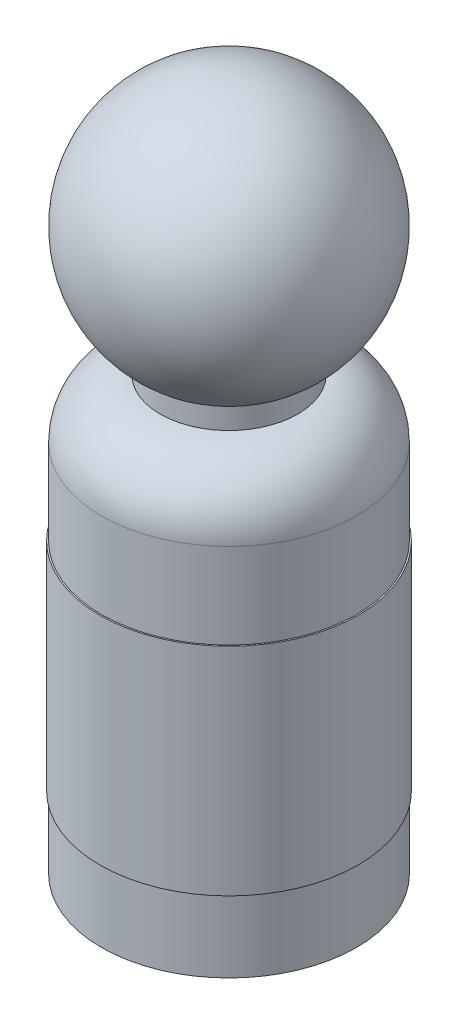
ISO-10303-21;
HEADER;
FILE_DESCRIPTION(('STEP AP214'),'2;1');
FILE_NAME('part.step','',(''),(''),'','','');
FILE_SCHEMA(('AUTOMOTIVE_DESIGN { 1 0 10303 214 1 1 1 1 }'));
ENDSEC;
DATA;
#1=APPLICATION_CONTEXT('core data for automotive mechanical design processes');
#2=APPLICATION_PROTOCOL_DEFINITION('international standard','automotive_design',2000,#1);
#3=PRODUCT_CONTEXT('',#1,'mechanical');
#4=PRODUCT('Part','Part','',(#3));
#5=PRODUCT_RELATED_PRODUCT_CATEGORY('part','',(#4));
#6=PRODUCT_DEFINITION_FORMATION('','',#4);
#7=PRODUCT_DEFINITION_CONTEXT('part definition',#1,'design');
#8=PRODUCT_DEFINITION('design','',#6,#7);
#9=PRODUCT_DEFINITION_SHAPE('','',#8);
#10=(LENGTH_UNIT() NAMED_UNIT(*) SI_UNIT(.MILLI.,.METRE.));
#11=(NAMED_UNIT(*) PLANE_ANGLE_UNIT() SI_UNIT($,.RADIAN.));
#12=(NAMED_UNIT(*) SI_UNIT($,.STERADIAN.) SOLID_ANGLE_UNIT());
#13=UNCERTAINTY_MEASURE_WITH_UNIT(LENGTH_MEASURE(1.E-05),#10,'distance_accuracy_value','');
#14=(GEOMETRIC_REPRESENTATION_CONTEXT(3) GLOBAL_UNCERTAINTY_ASSIGNED_CONTEXT((#13)) GLOBAL_UNIT_ASSIGNED_CONTEXT((#10,
#11,#12)) REPRESENTATION_CONTEXT('',''));
#15=CARTESIAN_POINT('',(0.,0.,0.));
#16=DIRECTION('',(0.,0.,1.));
#17=DIRECTION('',(1.,0.,0.));
#18=AXIS2_PLACEMENT_3D('',#15,#16,#17);
#19=CARTESIAN_POINT('',(0.,38.1,0.));
#20=DIRECTION('',(0.,-1.,0.));
#21=DIRECTION('',(0.,0.,-1.));
#22=AXIS2_PLACEMENT_3D('',#19,#20,#21);
#23=CYLINDRICAL_SURFACE('',#22,11.2395);
#24=CARTESIAN_POINT('',(0.,32.9184,0.));
#25=DIRECTION('',(0.,1.,0.));
#26=DIRECTION('',(0.,0.,1.));
#27=AXIS2_PLACEMENT_3D('',#24,#25,#26);
#28=CIRCLE('',#27,11.2395);
#29=CARTESIAN_POINT('',(0.,32.9184,-11.2395));
#30=VERTEX_POINT('',#29);
#31=EDGE_CURVE('E40',#30,#30,#28,.F.);
#32=CARTESIAN_POINT('',(0.,25.4,0.));
#33=DIRECTION('',(0.,-1.,0.));
#34=DIRECTION('',(0.,0.,-1.));
#35=AXIS2_PLACEMENT_3D('',#32,#33,#34);
#36=CIRCLE('',#35,11.2395);
#37=CARTESIAN_POINT('',(0.,25.4,-11.2395));
#38=VERTEX_POINT('',#37);
#39=EDGE_CURVE('E10',#38,#38,#36,.T.);
#40=CARTESIAN_POINT('',(0.,32.9184,-11.2395));
#41=CARTESIAN_POINT('',(0.,32.8400833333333,-11.2395));
#42=CARTESIAN_POINT('',(0.,32.7617666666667,-11.2395));
#43=CARTESIAN_POINT('',(0.,32.6051333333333,-11.2395));
#44=CARTESIAN_POINT('',(0.,32.5268166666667,-11.2395));
#45=CARTESIAN_POINT('',(0.,32.3701833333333,-11.2395));
#46=CARTESIAN_POINT('',(0.,32.2918666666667,-11.2395));
#47=CARTESIAN_POINT('',(0.,32.1352333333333,-11.2395));
#48=CARTESIAN_POINT('',(0.,32.0569166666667,-11.2395));
#49=CARTESIAN_POINT('',(0.,31.9002833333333,-11.2395));
#50=CARTESIAN_POINT('',(0.,31.8219666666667,-11.2395));
#51=CARTESIAN_POINT('',(0.,31.6653333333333,-11.2395));
#52=CARTESIAN_POINT('',(0.,31.5870166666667,-11.2395));
#53=CARTESIAN_POINT('',(0.,31.4303833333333,-11.2395));
#54=CARTESIAN_POINT('',(0.,31.3520666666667,-11.2395));
#55=CARTESIAN_POINT('',(0.,31.1954333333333,-11.2395));
#56=CARTESIAN_POINT('',(0.,31.1171166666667,-11.2395));
#57=CARTESIAN_POINT('',(0.,30.9604833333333,-11.2395));
#58=CARTESIAN_POINT('',(0.,30.8821666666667,-11.2395));
#59=CARTESIAN_POINT('',(0.,30.7255333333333,-11.2395));
#60=CARTESIAN_POINT('',(0.,30.6472166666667,-11.2395));
#61=CARTESIAN_POINT('',(0.,30.4905833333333,-11.2395));
#62=CARTESIAN_POINT('',(0.,30.4122666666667,-11.2395));
#63=CARTESIAN_POINT('',(0.,30.2556333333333,-11.2395));
#64=CARTESIAN_POINT('',(0.,30.1773166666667,-11.2395));
#65=CARTESIAN_POINT('',(0.,30.0206833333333,-11.2395));
#66=CARTESIAN_POINT('',(0.,29.9423666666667,-11.2395));
#67=CARTESIAN_POINT('',(0.,29.7857333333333,-11.2395));
#68=CARTESIAN_POINT('',(0.,29.7074166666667,-11.2395));
#69=CARTESIAN_POINT('',(0.,29.5507833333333,-11.2395));
#70=CARTESIAN_POINT('',(0.,29.4724666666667,-11.2395));
#71=CARTESIAN_POINT('',(0.,29.3158333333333,-11.2395));
#72=CARTESIAN_POINT('',(0.,29.2375166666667,-11.2395));
#73=CARTESIAN_POINT('',(0.,29.0808833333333,-11.2395));
#74=CARTESIAN_POINT('',(0.,29.0025666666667,-11.2395));
#75=CARTESIAN_POINT('',(0.,28.8459333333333,-11.2395));
#76=CARTESIAN_POINT('',(0.,28.7676166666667,-11.2395));
#77=CARTESIAN_POINT('',(0.,28.6109833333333,-11.2395));
#78=CARTESIAN_POINT('',(0.,28.5326666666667,-11.2395));
#79=CARTESIAN_POINT('',(0.,28.3760333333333,-11.2395));
#80=CARTESIAN_POINT('',(0.,28.2977166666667,-11.2395));
#81=CARTESIAN_POINT('',(0.,28.1410833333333,-11.2395));
#82=CARTESIAN_POINT('',(0.,28.0627666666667,-11.2395));
#83=CARTESIAN_POINT('',(0.,27.9061333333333,-11.2395));
#84=CARTESIAN_POINT('',(0.,27.8278166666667,-11.2395));
#85=CARTESIAN_POINT('',(0.,27.6711833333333,-11.2395));
#86=CARTESIAN_POINT('',(0.,27.5928666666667,-11.2395));
#87=CARTESIAN_POINT('',(0.,27.4362333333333,-11.2395));
#88=CARTESIAN_POINT('',(0.,27.3579166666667,-11.2395));
#89=CARTESIAN_POINT('',(0.,27.2012833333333,-11.2395));
#90=CARTESIAN_POINT('',(0.,27.1229666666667,-11.2395));
#91=CARTESIAN_POINT('',(0.,26.9663333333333,-11.2395));
#92=CARTESIAN_POINT('',(0.,26.8880166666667,-11.2395));
#93=CARTESIAN_POINT('',(0.,26.7313833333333,-11.2395));
#94=CARTESIAN_POINT('',(0.,26.6530666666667,-11.2395));
#95=CARTESIAN_POINT('',(0.,26.4964333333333,-11.2395));
#96=CARTESIAN_POINT('',(0.,26.4181166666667,-11.2395));
#97=CARTESIAN_POINT('',(0.,26.2614833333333,-11.2395));
#98=CARTESIAN_POINT('',(0.,26.1831666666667,-11.2395));
#99=CARTESIAN_POINT('',(0.,26.0265333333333,-11.2395));
#100=CARTESIAN_POINT('',(0.,25.9482166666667,-11.2395));
#101=CARTESIAN_POINT('',(0.,25.7915833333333,-11.2395));
#102=CARTESIAN_POINT('',(0.,25.7132666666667,-11.2395));
#103=CARTESIAN_POINT('',(0.,25.5566333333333,-11.2395));
#104=CARTESIAN_POINT('',(0.,25.4783166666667,-11.2395));
#105=CARTESIAN_POINT('',(0.,25.4,-11.2395));
#106=B_SPLINE_CURVE_WITH_KNOTS('',3,(#40,#41,#42,#43,#44,#45,#46,#47,#48,#49,#50,#51,#52,#53,
#54,#55,#56,#57,#58,#59,#60,#61,#62,#63,#64,#65,#66,#67,#68,#69,#70,#71,#72,#73,#74,#75,#76,#77,
#78,#79,#80,#81,#82,#83,#84,#85,#86,#87,#88,#89,#90,#91,#92,#93,#94,#95,#96,#97,#98,#99,#100,
#101,#102,#103,#104,#105),.UNSPECIFIED.,.F.,.F.,(4,2,2,2,2,2,2,2,2,2,2,2,2,2,2,2,2,2,2,2,2,2,2,
2,2,2,2,2,2,2,2,2,4),(0.,0.234949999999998,0.469899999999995,0.70485,0.939799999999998,1.17475,
1.4097,1.64465,1.8796,2.11455,2.3495,2.58445,2.81939999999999,3.05435,3.2893,3.52424999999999,
3.7592,3.99414999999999,4.22909999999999,4.46405,4.69899999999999,4.93394999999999,
5.16889999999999,5.40384999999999,5.63879999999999,5.87374999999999,6.10869999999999,
6.34364999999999,6.57859999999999,6.81354999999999,7.04849999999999,7.28344999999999,
7.51839999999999),.UNSPECIFIED.);
#107=EDGE_CURVE('BSEAM33',#30,#38,#106,.T.);
#108=ORIENTED_EDGE('',*,*,#31,.T.);
#109=ORIENTED_EDGE('',*,*,#39,.F.);
#110=ORIENTED_EDGE('',*,*,#107,.T.);
#111=ORIENTED_EDGE('',*,*,#107,.F.);
#112=EDGE_LOOP('',(#108,#110,#109,#111));
#113=FACE_BOUND('',#112,.T.);
#114=ADVANCED_FACE('F33',(#113),#23,.T.);
#115=CARTESIAN_POINT('',(0.,32.9184,0.));
#116=DIRECTION('',(0.,1.,0.));
#117=DIRECTION('',(0.,0.,1.));
#118=AXIS2_PLACEMENT_3D('',#115,#116,#117);
#119=TOROIDAL_SURFACE('',#118,6.0579,5.1816);
#120=ORIENTED_EDGE('',*,*,#31,.F.);
#121=EDGE_LOOP('',(#120));
#122=FACE_BOUND('',#121,.T.);
#123=CARTESIAN_POINT('',(0.,38.1,0.));
#124=DIRECTION('',(0.,1.,0.));
#125=DIRECTION('',(0.,0.,1.));
#126=AXIS2_PLACEMENT_3D('',#123,#124,#125);
#127=CIRCLE('',#126,6.0579);
#128=CARTESIAN_POINT('',(0.,38.1,6.0579));
#129=VERTEX_POINT('',#128);
#130=EDGE_CURVE('E44',#129,#129,#127,.T.);
#131=ORIENTED_EDGE('',*,*,#130,.F.);
#132=EDGE_LOOP('',(#131));
#133=FACE_BOUND('',#132,.T.);
#134=ADVANCED_FACE('F35',(#122,#133),#119,.T.);
#135=CARTESIAN_POINT('',(0.,39.9415,0.));
#136=DIRECTION('',(0.,-1.,0.));
#137=DIRECTION('',(0.,0.,-1.));
#138=AXIS2_PLACEMENT_3D('',#135,#136,#137);
#139=CYLINDRICAL_SURFACE('',#138,6.0579);
#140=CARTESIAN_POINT('',(0.,39.9415,0.));
#141=DIRECTION('',(0.,1.,0.));
#142=DIRECTION('',(0.,0.,1.));
#143=AXIS2_PLACEMENT_3D('',#140,#141,#142);
#144=CIRCLE('',#143,6.0579);
#145=CARTESIAN_POINT('',(0.,39.9415,6.0579));
#146=VERTEX_POINT('',#145);
#147=EDGE_CURVE('E53',#146,#146,#144,.T.);
#148=ORIENTED_EDGE('',*,*,#147,.F.);
#149=EDGE_LOOP('',(#148));
#150=FACE_BOUND('',#149,.T.);
#151=ORIENTED_EDGE('',*,*,#130,.T.);
#152=EDGE_LOOP('',(#151));
#153=FACE_BOUND('',#152,.T.);
#154=ADVANCED_FACE('F87',(#150,#153),#139,.T.);
#155=CARTESIAN_POINT('',(0.,49.4087175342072,0.));
#156=DIRECTION('',(0.,1.,0.));
#157=DIRECTION('',(1.,0.,0.));
#158=AXIS2_PLACEMENT_3D('',#155,#156,#157);
#159=SPHERICAL_SURFACE('',#158,11.2395);
#160=ORIENTED_EDGE('',*,*,#147,.T.);
#161=EDGE_LOOP('',(#160));
#162=FACE_BOUND('',#161,.T.);
#163=ADVANCED_FACE('F79',(#162),#159,.T.);
#164=CARTESIAN_POINT('',(0.,25.4,0.));
#165=DIRECTION('',(0.,-1.,0.));
#166=DIRECTION('',(0.,0.,-1.));
#167=AXIS2_PLACEMENT_3D('',#164,#165,#166);
#168=CYLINDRICAL_SURFACE('',#167,11.3665);
#169=CARTESIAN_POINT('',(0.,25.4,0.));
#170=DIRECTION('',(0.,-1.,0.));
#171=DIRECTION('',(0.,0.,-1.));
#172=AXIS2_PLACEMENT_3D('',#169,#170,#171);
#173=CIRCLE('',#172,11.3665);
#174=CARTESIAN_POINT('',(0.,25.4,-11.3665));
#175=VERTEX_POINT('',#174);
#176=EDGE_CURVE('E56',#175,#175,#173,.T.);
#177=CARTESIAN_POINT('',(0.,6.35,0.));
#178=DIRECTION('',(0.,-1.,0.));
#179=DIRECTION('',(0.,0.,-1.));
#180=AXIS2_PLACEMENT_3D('',#177,#178,#179);
#181=CIRCLE('',#180,11.3665);
#182=CARTESIAN_POINT('',(0.,6.35,-11.3665));
#183=VERTEX_POINT('',#182);
#184=EDGE_CURVE('E57',#183,#183,#181,.T.);
#185=CARTESIAN_POINT('',(0.,25.4,-11.3665));
#186=CARTESIAN_POINT('',(0.,25.2015625,-11.3665));
#187=CARTESIAN_POINT('',(0.,25.003125,-11.3665));
#188=CARTESIAN_POINT('',(0.,24.60625,-11.3665));
#189=CARTESIAN_POINT('',(0.,24.4078125,-11.3665));
#190=CARTESIAN_POINT('',(0.,24.0109375,-11.3665));
#191=CARTESIAN_POINT('',(0.,23.8125,-11.3665));
#192=CARTESIAN_POINT('',(0.,23.415625,-11.3665));
#193=CARTESIAN_POINT('',(0.,23.2171875,-11.3665));
#194=CARTESIAN_POINT('',(0.,22.8203125,-11.3665));
#195=CARTESIAN_POINT('',(0.,22.621875,-11.3665));
#196=CARTESIAN_POINT('',(0.,22.225,-11.3665));
#197=CARTESIAN_POINT('',(0.,22.0265625,-11.3665));
#198=CARTESIAN_POINT('',(0.,21.6296875,-11.3665));
#199=CARTESIAN_POINT('',(0.,21.43125,-11.3665));
#200=CARTESIAN_POINT('',(0.,21.034375,-11.3665));
#201=CARTESIAN_POINT('',(0.,20.8359375,-11.3665));
#202=CARTESIAN_POINT('',(0.,20.4390625,-11.3665));
#203=CARTESIAN_POINT('',(0.,20.240625,-11.3665));
#204=CARTESIAN_POINT('',(0.,19.84375,-11.3665));
#205=CARTESIAN_POINT('',(0.,19.6453125,-11.3665));
#206=CARTESIAN_POINT('',(0.,19.2484375,-11.3665));
#207=CARTESIAN_POINT('',(0.,19.05,-11.3665));
#208=CARTESIAN_POINT('',(0.,18.653125,-11.3665));
#209=CARTESIAN_POINT('',(0.,18.4546875,-11.3665));
#210=CARTESIAN_POINT('',(0.,18.0578125,-11.3665));
#211=CARTESIAN_POINT('',(0.,17.859375,-11.3665));
#212=CARTESIAN_POINT('',(0.,17.4625,-11.3665));
#213=CARTESIAN_POINT('',(0.,17.2640625,-11.3665));
#214=CARTESIAN_POINT('',(0.,16.8671875,-11.3665));
#215=CARTESIAN_POINT('',(0.,16.66875,-11.3665));
#216=CARTESIAN_POINT('',(0.,16.271875,-11.3665));
#217=CARTESIAN_POINT('',(0.,16.0734375,-11.3665));
#218=CARTESIAN_POINT('',(0.,15.6765625,-11.3665));
#219=CARTESIAN_POINT('',(0.,15.478125,-11.3665));
#220=CARTESIAN_POINT('',(0.,15.08125,-11.3665));
#221=CARTESIAN_POINT('',(0.,14.8828125,-11.3665));
#222=CARTESIAN_POINT('',(0.,14.4859375,-11.3665));
#223=CARTESIAN_POINT('',(0.,14.2875,-11.3665));
#224=CARTESIAN_POINT('',(0.,13.890625,-11.3665));
#225=CARTESIAN_POINT('',(0.,13.6921875,-11.3665));
#226=CARTESIAN_POINT('',(0.,13.2953125,-11.3665));
#227=CARTESIAN_POINT('',(0.,13.096875,-11.3665));
#228=CARTESIAN_POINT('',(0.,12.7,-11.3665));
#229=CARTESIAN_POINT('',(0.,12.5015625,-11.3665));
#230=CARTESIAN_POINT('',(0.,12.1046875,-11.3665));
#231=CARTESIAN_POINT('',(0.,11.90625,-11.3665));
#232=CARTESIAN_POINT('',(0.,11.509375,-11.3665));
#233=CARTESIAN_POINT('',(0.,11.3109375,-11.3665));
#234=CARTESIAN_POINT('',(0.,10.9140625,-11.3665));
#235=CARTESIAN_POINT('',(0.,10.715625,-11.3665));
#236=CARTESIAN_POINT('',(0.,10.31875,-11.3665));
#237=CARTESIAN_POINT('',(0.,10.1203125,-11.3665));
#238=CARTESIAN_POINT('',(0.,9.7234375,-11.3665));
#239=CARTESIAN_POINT('',(0.,9.525,-11.3665));
#240=CARTESIAN_POINT('',(0.,9.128125,-11.3665));
#241=CARTESIAN_POINT('',(0.,8.9296875,-11.3665));
#242=CARTESIAN_POINT('',(0.,8.5328125,-11.3665));
#243=CARTESIAN_POINT('',(0.,8.334375,-11.3665));
#244=CARTESIAN_POINT('',(0.,7.9375,-11.3665));
#245=CARTESIAN_POINT('',(0.,7.7390625,-11.3665));
#246=CARTESIAN_POINT('',(0.,7.3421875,-11.3665));
#247=CARTESIAN_POINT('',(0.,7.14375,-11.3665));
#248=CARTESIAN_POINT('',(0.,6.746875,-11.3665));
#249=CARTESIAN_POINT('',(0.,6.5484375,-11.3665));
#250=CARTESIAN_POINT('',(0.,6.35,-11.3665));
#251=B_SPLINE_CURVE_WITH_KNOTS('',3,(#185,#186,#187,#188,#189,#190,#191,#192,#193,#194,#195,
#196,#197,#198,#199,#200,#201,#202,#203,#204,#205,#206,#207,#208,#209,#210,#211,#212,#213,#214,
#215,#216,#217,#218,#219,#220,#221,#222,#223,#224,#225,#226,#227,#228,#229,#230,#231,#232,#233,
#234,#235,#236,#237,#238,#239,#240,#241,#242,#243,#244,#245,#246,#247,#248,#249,#250),
.UNSPECIFIED.,.F.,.F.,(4,2,2,2,2,2,2,2,2,2,2,2,2,2,2,2,2,2,2,2,2,2,2,2,2,2,2,2,2,2,2,2,4),(0.,
0.595312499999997,1.190625,1.7859375,2.38125,2.9765625,3.571875,4.1671875,4.7625,5.3578125,
5.953125,6.5484375,7.14375,7.7390625,8.334375,8.9296875,9.525,10.1203125,10.715625,11.3109375,
11.90625,12.5015625,13.096875,13.6921875,14.2875,14.8828125,15.478125,16.0734375,16.66875,
17.2640625,17.859375,18.4546875,19.05),.UNSPECIFIED.);
#252=EDGE_CURVE('BSEAM77',#175,#183,#251,.T.);
#253=ORIENTED_EDGE('',*,*,#176,.T.);
#254=ORIENTED_EDGE('',*,*,#184,.F.);
#255=ORIENTED_EDGE('',*,*,#252,.T.);
#256=ORIENTED_EDGE('',*,*,#252,.F.);
#257=EDGE_LOOP('',(#253,#255,#254,#256));
#258=FACE_BOUND('',#257,.T.);
#259=ADVANCED_FACE('F77',(#258),#168,.T.);
#260=CARTESIAN_POINT('',(0.,25.4,0.));
#261=DIRECTION('',(0.,-1.,0.));
#262=DIRECTION('',(0.,0.,-1.));
#263=AXIS2_PLACEMENT_3D('',#260,#261,#262);
#264=PLANE('',#263);
#265=ORIENTED_EDGE('',*,*,#39,.T.);
#266=EDGE_LOOP('',(#265));
#267=FACE_BOUND('',#266,.T.);
#268=ORIENTED_EDGE('',*,*,#176,.F.);
#269=EDGE_LOOP('',(#268));
#270=FACE_BOUND('',#269,.T.);
#271=ADVANCED_FACE('F73',(#267,#270),#264,.F.);
#272=CARTESIAN_POINT('',(0.,6.35,0.));
#273=DIRECTION('',(0.,-1.,0.));
#274=DIRECTION('',(0.,0.,-1.));
#275=AXIS2_PLACEMENT_3D('',#272,#273,#274);
#276=PLANE('',#275);
#277=CARTESIAN_POINT('',(0.,6.35,0.));
#278=DIRECTION('',(0.,-1.,0.));
#279=DIRECTION('',(0.,0.,-1.));
#280=AXIS2_PLACEMENT_3D('',#277,#278,#279);
#281=CIRCLE('',#280,11.2395);
#282=CARTESIAN_POINT('',(0.,6.34999999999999,-11.2395));
#283=VERTEX_POINT('',#282);
#284=EDGE_CURVE('E60',#283,#283,#281,.T.);
#285=ORIENTED_EDGE('',*,*,#284,.F.);
#286=EDGE_LOOP('',(#285));
#287=FACE_BOUND('',#286,.T.);
#288=ORIENTED_EDGE('',*,*,#184,.T.);
#289=EDGE_LOOP('',(#288));
#290=FACE_BOUND('',#289,.T.);
#291=ADVANCED_FACE('F69',(#287,#290),#276,.T.);
#292=CARTESIAN_POINT('',(0.,0.,0.));
#293=DIRECTION('',(0.,1.,0.));
#294=DIRECTION('',(0.,0.,1.));
#295=AXIS2_PLACEMENT_3D('',#292,#293,#294);
#296=PLANE('',#295);
#297=CARTESIAN_POINT('',(0.,0.,0.));
#298=DIRECTION('',(0.,1.,0.));
#299=DIRECTION('',(0.,0.,1.));
#300=AXIS2_PLACEMENT_3D('',#297,#298,#299);
#301=CIRCLE('',#300,11.2395);
#302=CARTESIAN_POINT('',(0.,0.,-11.2395));
#303=VERTEX_POINT('',#302);
#304=EDGE_CURVE('E48',#303,#303,#301,.T.);
#305=ORIENTED_EDGE('',*,*,#304,.F.);
#306=EDGE_LOOP('',(#305));
#307=FACE_BOUND('',#306,.T.);
#308=ADVANCED_FACE('F72',(#307),#296,.F.);
#309=CARTESIAN_POINT('',(0.,6.34999999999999,-11.2395));
#310=CARTESIAN_POINT('',(0.,6.28385416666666,-11.2395));
#311=CARTESIAN_POINT('',(0.,6.21770833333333,-11.2395));
#312=CARTESIAN_POINT('',(0.,6.08541666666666,-11.2395));
#313=CARTESIAN_POINT('',(0.,6.01927083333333,-11.2395));
#314=CARTESIAN_POINT('',(0.,5.88697916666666,-11.2395));
#315=CARTESIAN_POINT('',(0.,5.82083333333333,-11.2395));
#316=CARTESIAN_POINT('',(0.,5.68854166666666,-11.2395));
#317=CARTESIAN_POINT('',(0.,5.62239583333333,-11.2395));
#318=CARTESIAN_POINT('',(0.,5.49010416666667,-11.2395));
#319=CARTESIAN_POINT('',(0.,5.42395833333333,-11.2395));
#320=CARTESIAN_POINT('',(0.,5.29166666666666,-11.2395));
#321=CARTESIAN_POINT('',(0.,5.22552083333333,-11.2395));
#322=CARTESIAN_POINT('',(0.,5.09322916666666,-11.2395));
#323=CARTESIAN_POINT('',(0.,5.02708333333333,-11.2395));
#324=CARTESIAN_POINT('',(0.,4.89479166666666,-11.2395));
#325=CARTESIAN_POINT('',(0.,4.82864583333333,-11.2395));
#326=CARTESIAN_POINT('',(0.,4.69635416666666,-11.2395));
#327=CARTESIAN_POINT('',(0.,4.63020833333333,-11.2395));
#328=CARTESIAN_POINT('',(0.,4.49791666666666,-11.2395));
#329=CARTESIAN_POINT('',(0.,4.43177083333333,-11.2395));
#330=CARTESIAN_POINT('',(0.,4.29947916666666,-11.2395));
#331=CARTESIAN_POINT('',(0.,4.23333333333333,-11.2395));
#332=CARTESIAN_POINT('',(0.,4.10104166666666,-11.2395));
#333=CARTESIAN_POINT('',(0.,4.03489583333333,-11.2395));
#334=CARTESIAN_POINT('',(0.,3.90260416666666,-11.2395));
#335=CARTESIAN_POINT('',(0.,3.83645833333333,-11.2395));
#336=CARTESIAN_POINT('',(0.,3.70416666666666,-11.2395));
#337=CARTESIAN_POINT('',(0.,3.63802083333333,-11.2395));
#338=CARTESIAN_POINT('',(0.,3.50572916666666,-11.2395));
#339=CARTESIAN_POINT('',(0.,3.43958333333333,-11.2395));
#340=CARTESIAN_POINT('',(0.,3.30729166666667,-11.2395));
#341=CARTESIAN_POINT('',(0.,3.24114583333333,-11.2395));
#342=CARTESIAN_POINT('',(0.,3.10885416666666,-11.2395));
#343=CARTESIAN_POINT('',(0.,3.04270833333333,-11.2395));
#344=CARTESIAN_POINT('',(0.,2.91041666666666,-11.2395));
#345=CARTESIAN_POINT('',(0.,2.84427083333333,-11.2395));
#346=CARTESIAN_POINT('',(0.,2.71197916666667,-11.2395));
#347=CARTESIAN_POINT('',(0.,2.64583333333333,-11.2395));
#348=CARTESIAN_POINT('',(0.,2.51354166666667,-11.2395));
#349=CARTESIAN_POINT('',(0.,2.44739583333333,-11.2395));
#350=CARTESIAN_POINT('',(0.,2.31510416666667,-11.2395));
#351=CARTESIAN_POINT('',(0.,2.24895833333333,-11.2395));
#352=CARTESIAN_POINT('',(0.,2.11666666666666,-11.2395));
#353=CARTESIAN_POINT('',(0.,2.05052083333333,-11.2395));
#354=CARTESIAN_POINT('',(0.,1.91822916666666,-11.2395));
#355=CARTESIAN_POINT('',(0.,1.85208333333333,-11.2395));
#356=CARTESIAN_POINT('',(0.,1.71979166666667,-11.2395));
#357=CARTESIAN_POINT('',(0.,1.65364583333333,-11.2395));
#358=CARTESIAN_POINT('',(0.,1.52135416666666,-11.2395));
#359=CARTESIAN_POINT('',(0.,1.45520833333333,-11.2395));
#360=CARTESIAN_POINT('',(0.,1.32291666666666,-11.2395));
#361=CARTESIAN_POINT('',(0.,1.25677083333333,-11.2395));
#362=CARTESIAN_POINT('',(0.,1.12447916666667,-11.2395));
#363=CARTESIAN_POINT('',(0.,1.05833333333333,-11.2395));
#364=CARTESIAN_POINT('',(0.,0.926041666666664,-11.2395));
#365=CARTESIAN_POINT('',(0.,0.85989583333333,-11.2395));
#366=CARTESIAN_POINT('',(0.,0.727604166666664,-11.2395));
#367=CARTESIAN_POINT('',(0.,0.661458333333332,-11.2395));
#368=CARTESIAN_POINT('',(0.,0.529166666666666,-11.2395));
#369=CARTESIAN_POINT('',(0.,0.463020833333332,-11.2395));
#370=CARTESIAN_POINT('',(0.,0.330729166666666,-11.2395));
#371=CARTESIAN_POINT('',(0.,0.264583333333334,-11.2395));
#372=CARTESIAN_POINT('',(0.,0.132291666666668,-11.2395));
#373=CARTESIAN_POINT('',(0.,0.0661458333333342,-11.2395));
#374=CARTESIAN_POINT('',(0.,0.,-11.2395));
#375=B_SPLINE_CURVE_WITH_KNOTS('',3,(#309,#310,#311,#312,#313,#314,#315,#316,#317,#318,#319,
#320,#321,#322,#323,#324,#325,#326,#327,#328,#329,#330,#331,#332,#333,#334,#335,#336,#337,#338,
#339,#340,#341,#342,#343,#344,#345,#346,#347,#348,#349,#350,#351,#352,#353,#354,#355,#356,#357,
#358,#359,#360,#361,#362,#363,#364,#365,#366,#367,#368,#369,#370,#371,#372,#373,#374),
.UNSPECIFIED.,.F.,.F.,(4,2,2,2,2,2,2,2,2,2,2,2,2,2,2,2,2,2,2,2,2,2,2,2,2,2,2,2,2,2,2,2,4),(0.,
0.198437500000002,0.396874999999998,0.5953125,0.793749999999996,0.992187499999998,1.190625,
1.3890625,1.5875,1.7859375,1.984375,2.1828125,2.38125,2.5796875,2.778125,2.97656249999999,3.175,
3.3734375,3.571875,3.7703125,3.96874999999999,4.1671875,4.365625,4.56406249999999,4.7625,
4.9609375,5.15937499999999,5.3578125,5.55625,5.75468749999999,5.953125,6.15156249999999,
6.34999999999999),.UNSPECIFIED.);
#376=EDGE_CURVE('BSEAM66',#283,#303,#375,.T.);
#377=ORIENTED_EDGE('',*,*,#284,.T.);
#378=ORIENTED_EDGE('',*,*,#304,.T.);
#379=ORIENTED_EDGE('',*,*,#376,.T.);
#380=ORIENTED_EDGE('',*,*,#376,.F.);
#381=EDGE_LOOP('',(#377,#379,#378,#380));
#382=FACE_BOUND('',#381,.T.);
#383=ADVANCED_FACE('F66',(#382),#23,.T.);
#384=CLOSED_SHELL('',(#114,#134,#154,#163,#259,#271,#291,#308,#383));
#385=MANIFOLD_SOLID_BREP('B2',#384);
#386=ADVANCED_BREP_SHAPE_REPRESENTATION('',(#18,#385),#14);
#387=SHAPE_DEFINITION_REPRESENTATION(#9,#386);
ENDSEC;
END-ISO-10303-21;
